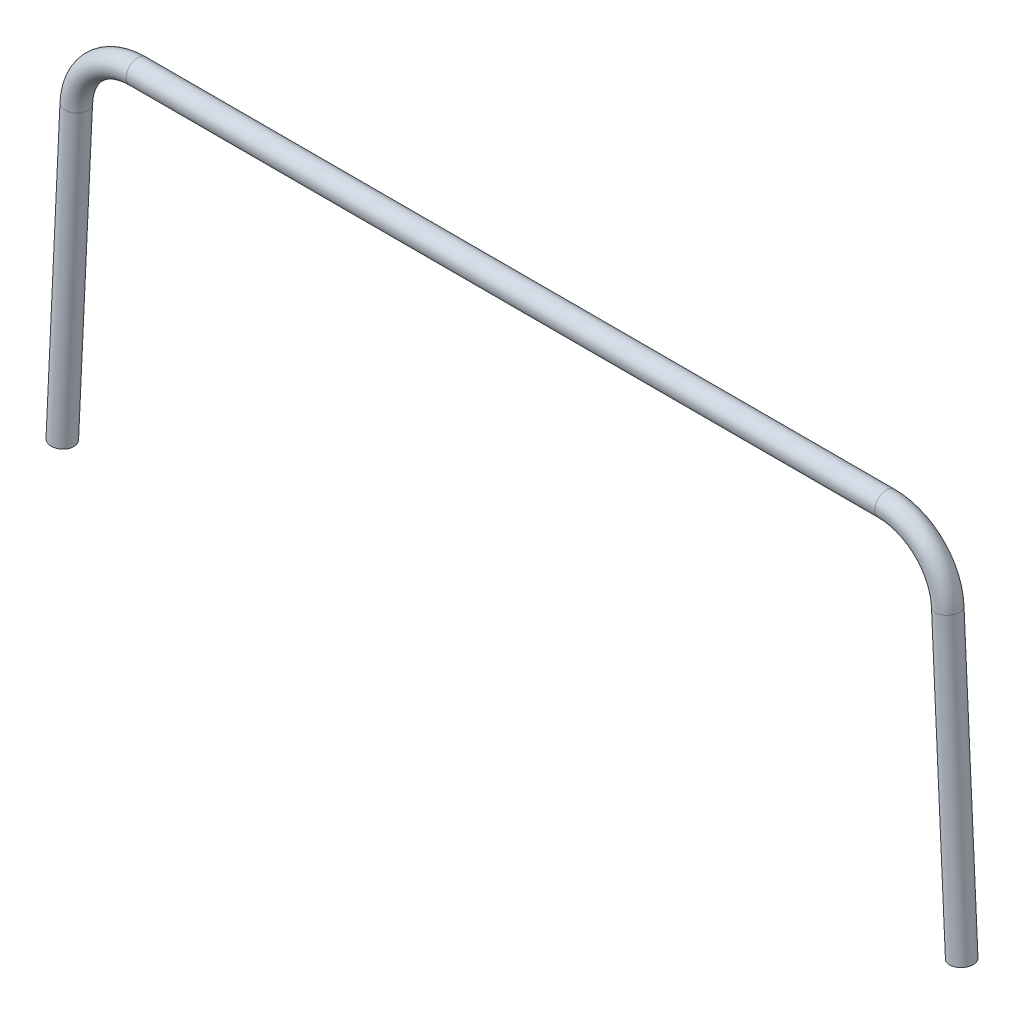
ISO-10303-21;
HEADER;
FILE_DESCRIPTION(('STEP AP214'),'2;1');
FILE_NAME('part.step','',(''),(''),'','','');
FILE_SCHEMA(('AUTOMOTIVE_DESIGN { 1 0 10303 214 1 1 1 1 }'));
ENDSEC;
DATA;
#1=APPLICATION_CONTEXT('core data for automotive mechanical design processes');
#2=APPLICATION_PROTOCOL_DEFINITION('international standard','automotive_design',2000,#1);
#3=PRODUCT_CONTEXT('',#1,'mechanical');
#4=PRODUCT('Part','Part','',(#3));
#5=PRODUCT_RELATED_PRODUCT_CATEGORY('part','',(#4));
#6=PRODUCT_DEFINITION_FORMATION('','',#4);
#7=PRODUCT_DEFINITION_CONTEXT('part definition',#1,'design');
#8=PRODUCT_DEFINITION('design','',#6,#7);
#9=PRODUCT_DEFINITION_SHAPE('','',#8);
#10=(LENGTH_UNIT() NAMED_UNIT(*) SI_UNIT(.MILLI.,.METRE.));
#11=(NAMED_UNIT(*) PLANE_ANGLE_UNIT() SI_UNIT($,.RADIAN.));
#12=(NAMED_UNIT(*) SI_UNIT($,.STERADIAN.) SOLID_ANGLE_UNIT());
#13=UNCERTAINTY_MEASURE_WITH_UNIT(LENGTH_MEASURE(1.E-05),#10,'distance_accuracy_value','');
#14=(GEOMETRIC_REPRESENTATION_CONTEXT(3) GLOBAL_UNCERTAINTY_ASSIGNED_CONTEXT((#13)) GLOBAL_UNIT_ASSIGNED_CONTEXT((#10,
#11,#12)) REPRESENTATION_CONTEXT('',''));
#15=CARTESIAN_POINT('',(0.,0.,0.));
#16=DIRECTION('',(0.,0.,1.));
#17=DIRECTION('',(1.,0.,0.));
#18=AXIS2_PLACEMENT_3D('',#15,#16,#17);
#19=CARTESIAN_POINT('',(719.823686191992,-115.8875,0.));
#20=DIRECTION('',(0.046874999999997,-0.998900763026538,0.));
#21=DIRECTION('',(0.998900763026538,0.046874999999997,0.));
#22=AXIS2_PLACEMENT_3D('',#19,#20,#21);
#23=CYLINDRICAL_SURFACE('',#22,17.8054);
#24=CARTESIAN_POINT('',(742.929059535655,-608.260301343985,0.));
#25=DIRECTION('',(-0.0468749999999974,0.998900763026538,0.));
#26=DIRECTION('',(-0.998900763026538,-0.0468749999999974,0.));
#27=AXIS2_PLACEMENT_3D('',#24,#25,#26);
#28=CIRCLE('',#27,17.8054);
#29=CARTESIAN_POINT('',(725.143231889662,-609.094929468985,0.));
#30=VERTEX_POINT('',#29);
#31=EDGE_CURVE('E54',#30,#30,#28,.T.);
#32=ORIENTED_EDGE('',*,*,#31,.F.);
#33=EDGE_LOOP('',(#32));
#34=FACE_BOUND('',#33,.T.);
#35=CARTESIAN_POINT('',(719.823686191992,-115.887500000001,0.));
#36=DIRECTION('',(-0.0468749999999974,0.998900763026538,0.));
#37=DIRECTION('',(-0.998900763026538,-0.0468749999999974,0.));
#38=AXIS2_PLACEMENT_3D('',#35,#36,#37);
#39=CIRCLE('',#38,17.8054);
#40=CARTESIAN_POINT('',(702.037858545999,-116.722128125,0.));
#41=VERTEX_POINT('',#40);
#42=EDGE_CURVE('E50',#41,#41,#39,.T.);
#43=ORIENTED_EDGE('',*,*,#42,.T.);
#44=EDGE_LOOP('',(#43));
#45=FACE_BOUND('',#44,.T.);
#46=ADVANCED_FACE('F46',(#34,#45),#23,.F.);
#47=CARTESIAN_POINT('',(719.823686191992,-115.8875,0.));
#48=DIRECTION('',(0.046874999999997,-0.998900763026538,0.));
#49=DIRECTION('',(0.998900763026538,0.046874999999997,0.));
#50=AXIS2_PLACEMENT_3D('',#47,#48,#49);
#51=CYLINDRICAL_SURFACE('',#50,19.05);
#52=CARTESIAN_POINT('',(742.929059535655,-608.260301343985,0.));
#53=DIRECTION('',(-0.0468749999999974,0.998900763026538,0.));
#54=DIRECTION('',(-0.998900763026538,-0.0468749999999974,0.));
#55=AXIS2_PLACEMENT_3D('',#52,#53,#54);
#56=CIRCLE('',#55,19.05);
#57=CARTESIAN_POINT('',(723.899999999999,-609.153270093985,0.));
#58=VERTEX_POINT('',#57);
#59=EDGE_CURVE('E58',#58,#58,#56,.T.);
#60=ORIENTED_EDGE('',*,*,#59,.T.);
#61=EDGE_LOOP('',(#60));
#62=FACE_BOUND('',#61,.T.);
#63=CARTESIAN_POINT('',(719.823686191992,-115.887500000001,0.));
#64=DIRECTION('',(-0.0468749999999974,0.998900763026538,0.));
#65=DIRECTION('',(-0.998900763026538,-0.0468749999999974,0.));
#66=AXIS2_PLACEMENT_3D('',#63,#64,#65);
#67=CIRCLE('',#66,19.05);
#68=CARTESIAN_POINT('',(700.794626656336,-116.78046875,0.));
#69=VERTEX_POINT('',#68);
#70=EDGE_CURVE('E12',#69,#69,#67,.T.);
#71=ORIENTED_EDGE('',*,*,#70,.F.);
#72=EDGE_LOOP('',(#71));
#73=FACE_BOUND('',#72,.T.);
#74=ADVANCED_FACE('F73',(#62,#73),#51,.T.);
#75=CARTESIAN_POINT('',(742.929059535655,-608.260301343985,0.));
#76=DIRECTION('',(-0.0468749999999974,0.998900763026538,0.));
#77=DIRECTION('',(-0.998900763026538,-0.0468749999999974,0.));
#78=AXIS2_PLACEMENT_3D('',#75,#76,#77);
#79=PLANE('',#78);
#80=ORIENTED_EDGE('',*,*,#31,.T.);
#81=EDGE_LOOP('',(#80));
#82=FACE_BOUND('',#81,.T.);
#83=ORIENTED_EDGE('',*,*,#59,.F.);
#84=EDGE_LOOP('',(#83));
#85=FACE_BOUND('',#84,.T.);
#86=ADVANCED_FACE('F69',(#82,#85),#79,.F.);
#87=CARTESIAN_POINT('',(719.823686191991,-115.887500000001,0.));
#88=DIRECTION('',(-0.0468749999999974,0.998900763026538,0.));
#89=DIRECTION('',(-0.998900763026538,-0.0468749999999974,0.));
#90=AXIS2_PLACEMENT_3D('',#87,#88,#89);
#91=PLANE('',#90);
#92=ORIENTED_EDGE('',*,*,#42,.F.);
#93=EDGE_LOOP('',(#92));
#94=FACE_BOUND('',#93,.T.);
#95=ORIENTED_EDGE('',*,*,#70,.T.);
#96=EDGE_LOOP('',(#95));
#97=FACE_BOUND('',#96,.T.);
#98=ADVANCED_FACE('F48',(#94,#97),#91,.T.);
#99=CLOSED_SHELL('',(#46,#74,#86,#98));
#100=MANIFOLD_SOLID_BREP('B2',#99);
#101=CARTESIAN_POINT('',(618.335368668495,-120.65,0.));
#102=DIRECTION('',(0.,0.,-1.));
#103=DIRECTION('',(-1.,0.,0.));
#104=AXIS2_PLACEMENT_3D('',#101,#102,#103);
#105=TOROIDAL_SURFACE('',#104,101.600000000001,17.8054);
#106=CARTESIAN_POINT('',(618.335368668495,-19.0499999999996,0.));
#107=DIRECTION('',(-1.,0.,0.));
#108=DIRECTION('',(0.,-1.,0.));
#109=AXIS2_PLACEMENT_3D('',#106,#107,#108);
#110=CIRCLE('',#109,17.8054);
#111=CARTESIAN_POINT('',(618.335368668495,-1.24459999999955,0.));
#112=VERTEX_POINT('',#111);
#113=EDGE_CURVE('E150',#112,#112,#110,.T.);
#114=CARTESIAN_POINT('',(719.823686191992,-115.8875,0.));
#115=DIRECTION('',(0.0468749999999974,-0.998900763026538,0.));
#116=DIRECTION('',(0.998900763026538,0.0468749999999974,0.));
#117=AXIS2_PLACEMENT_3D('',#114,#115,#116);
#118=CIRCLE('',#117,17.8054);
#119=CARTESIAN_POINT('',(737.609513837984,-115.052871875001,0.));
#120=VERTEX_POINT('',#119);
#121=EDGE_CURVE('E140',#120,#120,#118,.T.);
#122=CARTESIAN_POINT('',(618.335368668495,-120.65,0.));
#123=DIRECTION('',(0.,0.,-1.));
#124=DIRECTION('',(-1.,0.,0.));
#125=AXIS2_PLACEMENT_3D('',#122,#123,#124);
#126=CIRCLE('',#125,119.405400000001);
#127=EDGE_CURVE('',#112,#120,#126,.T.);
#128=ORIENTED_EDGE('',*,*,#113,.T.);
#129=ORIENTED_EDGE('',*,*,#121,.T.);
#130=ORIENTED_EDGE('',*,*,#127,.T.);
#131=ORIENTED_EDGE('',*,*,#127,.F.);
#132=EDGE_LOOP('',(#128,#130,#129,#131));
#133=FACE_BOUND('',#132,.T.);
#134=ADVANCED_FACE('F136',(#133),#105,.F.);
#135=CARTESIAN_POINT('',(618.335368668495,-120.65,0.));
#136=DIRECTION('',(0.,0.,-1.));
#137=DIRECTION('',(-1.,0.,0.));
#138=AXIS2_PLACEMENT_3D('',#135,#136,#137);
#139=TOROIDAL_SURFACE('',#138,101.600000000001,19.05);
#140=CARTESIAN_POINT('',(618.335368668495,-19.0499999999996,0.));
#141=DIRECTION('',(-1.,0.,0.));
#142=DIRECTION('',(0.,-1.,0.));
#143=AXIS2_PLACEMENT_3D('',#140,#141,#142);
#144=CIRCLE('',#143,19.05);
#145=CARTESIAN_POINT('',(618.335368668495,4.16333634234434E-13,0.));
#146=VERTEX_POINT('',#145);
#147=EDGE_CURVE('E144',#146,#146,#144,.T.);
#148=CARTESIAN_POINT('',(719.823686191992,-115.8875,0.));
#149=DIRECTION('',(0.0468749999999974,-0.998900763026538,0.));
#150=DIRECTION('',(0.998900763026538,0.0468749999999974,0.));
#151=AXIS2_PLACEMENT_3D('',#148,#149,#150);
#152=CIRCLE('',#151,19.05);
#153=CARTESIAN_POINT('',(738.852745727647,-114.994531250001,0.));
#154=VERTEX_POINT('',#153);
#155=EDGE_CURVE('E45',#154,#154,#152,.T.);
#156=CARTESIAN_POINT('',(618.335368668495,-120.65,0.));
#157=DIRECTION('',(0.,0.,-1.));
#158=DIRECTION('',(-1.,0.,0.));
#159=AXIS2_PLACEMENT_3D('',#156,#157,#158);
#160=CIRCLE('',#159,120.650000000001);
#161=EDGE_CURVE('',#146,#154,#160,.T.);
#162=ORIENTED_EDGE('',*,*,#147,.F.);
#163=ORIENTED_EDGE('',*,*,#155,.F.);
#164=ORIENTED_EDGE('',*,*,#161,.T.);
#165=ORIENTED_EDGE('',*,*,#161,.F.);
#166=EDGE_LOOP('',(#162,#164,#163,#165));
#167=FACE_BOUND('',#166,.T.);
#168=ADVANCED_FACE('F163',(#167),#139,.T.);
#169=CARTESIAN_POINT('',(618.335368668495,-19.05,0.));
#170=DIRECTION('',(-1.,0.,0.));
#171=DIRECTION('',(0.,-1.,0.));
#172=AXIS2_PLACEMENT_3D('',#169,#170,#171);
#173=PLANE('',#172);
#174=ORIENTED_EDGE('',*,*,#113,.F.);
#175=EDGE_LOOP('',(#174));
#176=FACE_BOUND('',#175,.T.);
#177=ORIENTED_EDGE('',*,*,#147,.T.);
#178=EDGE_LOOP('',(#177));
#179=FACE_BOUND('',#178,.T.);
#180=ADVANCED_FACE('F159',(#176,#179),#173,.T.);
#181=CARTESIAN_POINT('',(719.823686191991,-115.887500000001,0.));
#182=DIRECTION('',(0.0468749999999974,-0.998900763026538,0.));
#183=DIRECTION('',(0.998900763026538,0.0468749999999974,0.));
#184=AXIS2_PLACEMENT_3D('',#181,#182,#183);
#185=PLANE('',#184);
#186=ORIENTED_EDGE('',*,*,#121,.F.);
#187=EDGE_LOOP('',(#186));
#188=FACE_BOUND('',#187,.T.);
#189=ORIENTED_EDGE('',*,*,#155,.T.);
#190=EDGE_LOOP('',(#189));
#191=FACE_BOUND('',#190,.T.);
#192=ADVANCED_FACE('F138',(#188,#191),#185,.T.);
#193=CLOSED_SHELL('',(#134,#168,#180,#192));
#194=MANIFOLD_SOLID_BREP('B7',#193);
#195=CARTESIAN_POINT('',(-618.335368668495,-19.0499999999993,0.));
#196=DIRECTION('',(1.,0.,0.));
#197=DIRECTION('',(0.,1.,0.));
#198=AXIS2_PLACEMENT_3D('',#195,#196,#197);
#199=CYLINDRICAL_SURFACE('',#198,17.8054);
#200=CARTESIAN_POINT('',(-618.335368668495,-19.0499999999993,0.));
#201=DIRECTION('',(-1.,0.,0.));
#202=DIRECTION('',(0.,-1.,0.));
#203=AXIS2_PLACEMENT_3D('',#200,#201,#202);
#204=CIRCLE('',#203,17.8054);
#205=CARTESIAN_POINT('',(-618.335368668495,-36.8553999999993,0.));
#206=VERTEX_POINT('',#205);
#207=EDGE_CURVE('E242',#206,#206,#204,.T.);
#208=ORIENTED_EDGE('',*,*,#207,.T.);
#209=EDGE_LOOP('',(#208));
#210=FACE_BOUND('',#209,.T.);
#211=CARTESIAN_POINT('',(618.335368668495,-19.0499999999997,0.));
#212=DIRECTION('',(1.,0.,0.));
#213=DIRECTION('',(0.,1.,0.));
#214=AXIS2_PLACEMENT_3D('',#211,#212,#213);
#215=CIRCLE('',#214,17.8054);
#216=CARTESIAN_POINT('',(618.335368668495,-1.24459999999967,0.));
#217=VERTEX_POINT('',#216);
#218=EDGE_CURVE('E232',#217,#217,#215,.T.);
#219=ORIENTED_EDGE('',*,*,#218,.T.);
#220=EDGE_LOOP('',(#219));
#221=FACE_BOUND('',#220,.T.);
#222=ADVANCED_FACE('F228',(#210,#221),#199,.F.);
#223=CARTESIAN_POINT('',(-618.335368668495,-19.0499999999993,0.));
#224=DIRECTION('',(1.,0.,0.));
#225=DIRECTION('',(0.,1.,0.));
#226=AXIS2_PLACEMENT_3D('',#223,#224,#225);
#227=CYLINDRICAL_SURFACE('',#226,19.05);
#228=CARTESIAN_POINT('',(-618.335368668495,-19.0499999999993,0.));
#229=DIRECTION('',(-1.,0.,0.));
#230=DIRECTION('',(0.,-1.,0.));
#231=AXIS2_PLACEMENT_3D('',#228,#229,#230);
#232=CIRCLE('',#231,19.05);
#233=CARTESIAN_POINT('',(-618.335368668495,-38.0999999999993,0.));
#234=VERTEX_POINT('',#233);
#235=EDGE_CURVE('E236',#234,#234,#232,.T.);
#236=ORIENTED_EDGE('',*,*,#235,.F.);
#237=EDGE_LOOP('',(#236));
#238=FACE_BOUND('',#237,.T.);
#239=CARTESIAN_POINT('',(618.335368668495,-19.0499999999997,0.));
#240=DIRECTION('',(1.,0.,0.));
#241=DIRECTION('',(0.,1.,0.));
#242=AXIS2_PLACEMENT_3D('',#239,#240,#241);
#243=CIRCLE('',#242,19.05);
#244=CARTESIAN_POINT('',(618.335368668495,3.12250225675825E-13,0.));
#245=VERTEX_POINT('',#244);
#246=EDGE_CURVE('E135',#245,#245,#243,.T.);
#247=ORIENTED_EDGE('',*,*,#246,.F.);
#248=EDGE_LOOP('',(#247));
#249=FACE_BOUND('',#248,.T.);
#250=ADVANCED_FACE('F255',(#238,#249),#227,.T.);
#251=CARTESIAN_POINT('',(-618.335368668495,-19.0499999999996,0.));
#252=DIRECTION('',(-1.,0.,0.));
#253=DIRECTION('',(0.,-1.,0.));
#254=AXIS2_PLACEMENT_3D('',#251,#252,#253);
#255=PLANE('',#254);
#256=ORIENTED_EDGE('',*,*,#207,.F.);
#257=EDGE_LOOP('',(#256));
#258=FACE_BOUND('',#257,.T.);
#259=ORIENTED_EDGE('',*,*,#235,.T.);
#260=EDGE_LOOP('',(#259));
#261=FACE_BOUND('',#260,.T.);
#262=ADVANCED_FACE('F251',(#258,#261),#255,.T.);
#263=CARTESIAN_POINT('',(618.335368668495,-19.05,0.));
#264=DIRECTION('',(1.,0.,0.));
#265=DIRECTION('',(0.,1.,0.));
#266=AXIS2_PLACEMENT_3D('',#263,#264,#265);
#267=PLANE('',#266);
#268=ORIENTED_EDGE('',*,*,#218,.F.);
#269=EDGE_LOOP('',(#268));
#270=FACE_BOUND('',#269,.T.);
#271=ORIENTED_EDGE('',*,*,#246,.T.);
#272=EDGE_LOOP('',(#271));
#273=FACE_BOUND('',#272,.T.);
#274=ADVANCED_FACE('F230',(#270,#273),#267,.T.);
#275=CLOSED_SHELL('',(#222,#250,#262,#274));
#276=MANIFOLD_SOLID_BREP('B40',#275);
#277=CARTESIAN_POINT('',(-618.335368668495,-120.65,0.));
#278=DIRECTION('',(0.,0.,-1.));
#279=DIRECTION('',(-1.,0.,0.));
#280=AXIS2_PLACEMENT_3D('',#277,#278,#279);
#281=TOROIDAL_SURFACE('',#280,101.600000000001,17.8054);
#282=CARTESIAN_POINT('',(-719.823686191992,-115.8875,0.));
#283=DIRECTION('',(-0.0468750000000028,-0.998900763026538,0.));
#284=DIRECTION('',(0.998900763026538,-0.0468750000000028,0.));
#285=AXIS2_PLACEMENT_3D('',#282,#283,#284);
#286=CIRCLE('',#285,17.8054);
#287=CARTESIAN_POINT('',(-737.609513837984,-115.052871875,0.));
#288=VERTEX_POINT('',#287);
#289=EDGE_CURVE('E333',#288,#288,#286,.T.);
#290=CARTESIAN_POINT('',(-618.335368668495,-19.0499999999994,0.));
#291=DIRECTION('',(1.,0.,0.));
#292=DIRECTION('',(0.,1.,0.));
#293=AXIS2_PLACEMENT_3D('',#290,#291,#292);
#294=CIRCLE('',#293,17.8054);
#295=CARTESIAN_POINT('',(-618.335368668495,-1.24459999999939,0.));
#296=VERTEX_POINT('',#295);
#297=EDGE_CURVE('E323',#296,#296,#294,.T.);
#298=CARTESIAN_POINT('',(-618.335368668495,-120.65,0.));
#299=DIRECTION('',(0.,0.,-1.));
#300=DIRECTION('',(-1.,0.,0.));
#301=AXIS2_PLACEMENT_3D('',#298,#299,#300);
#302=CIRCLE('',#301,119.405400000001);
#303=EDGE_CURVE('',#288,#296,#302,.T.);
#304=ORIENTED_EDGE('',*,*,#289,.T.);
#305=ORIENTED_EDGE('',*,*,#297,.T.);
#306=ORIENTED_EDGE('',*,*,#303,.T.);
#307=ORIENTED_EDGE('',*,*,#303,.F.);
#308=EDGE_LOOP('',(#304,#306,#305,#307));
#309=FACE_BOUND('',#308,.T.);
#310=ADVANCED_FACE('F319',(#309),#281,.F.);
#311=CARTESIAN_POINT('',(-618.335368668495,-120.65,0.));
#312=DIRECTION('',(0.,0.,-1.));
#313=DIRECTION('',(-1.,0.,0.));
#314=AXIS2_PLACEMENT_3D('',#311,#312,#313);
#315=TOROIDAL_SURFACE('',#314,101.600000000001,19.05);
#316=CARTESIAN_POINT('',(-719.823686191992,-115.8875,0.));
#317=DIRECTION('',(-0.0468750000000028,-0.998900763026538,0.));
#318=DIRECTION('',(0.998900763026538,-0.0468750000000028,0.));
#319=AXIS2_PLACEMENT_3D('',#316,#317,#318);
#320=CIRCLE('',#319,19.05);
#321=CARTESIAN_POINT('',(-738.852745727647,-114.99453125,0.));
#322=VERTEX_POINT('',#321);
#323=EDGE_CURVE('E327',#322,#322,#320,.T.);
#324=CARTESIAN_POINT('',(-618.335368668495,-19.0499999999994,0.));
#325=DIRECTION('',(1.,0.,0.));
#326=DIRECTION('',(0.,1.,0.));
#327=AXIS2_PLACEMENT_3D('',#324,#325,#326);
#328=CIRCLE('',#327,19.05);
#329=CARTESIAN_POINT('',(-618.335368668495,5.96744875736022E-13,0.));
#330=VERTEX_POINT('',#329);
#331=EDGE_CURVE('E227',#330,#330,#328,.T.);
#332=CARTESIAN_POINT('',(-618.335368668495,-120.65,0.));
#333=DIRECTION('',(0.,0.,-1.));
#334=DIRECTION('',(-1.,0.,0.));
#335=AXIS2_PLACEMENT_3D('',#332,#333,#334);
#336=CIRCLE('',#335,120.650000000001);
#337=EDGE_CURVE('',#322,#330,#336,.T.);
#338=ORIENTED_EDGE('',*,*,#323,.F.);
#339=ORIENTED_EDGE('',*,*,#331,.F.);
#340=ORIENTED_EDGE('',*,*,#337,.T.);
#341=ORIENTED_EDGE('',*,*,#337,.F.);
#342=EDGE_LOOP('',(#338,#340,#339,#341));
#343=FACE_BOUND('',#342,.T.);
#344=ADVANCED_FACE('F346',(#343),#315,.T.);
#345=CARTESIAN_POINT('',(-719.823686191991,-115.8875,0.));
#346=DIRECTION('',(-0.0468750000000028,-0.998900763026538,0.));
#347=DIRECTION('',(0.998900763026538,-0.0468750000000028,0.));
#348=AXIS2_PLACEMENT_3D('',#345,#346,#347);
#349=PLANE('',#348);
#350=ORIENTED_EDGE('',*,*,#289,.F.);
#351=EDGE_LOOP('',(#350));
#352=FACE_BOUND('',#351,.T.);
#353=ORIENTED_EDGE('',*,*,#323,.T.);
#354=EDGE_LOOP('',(#353));
#355=FACE_BOUND('',#354,.T.);
#356=ADVANCED_FACE('F342',(#352,#355),#349,.T.);
#357=CARTESIAN_POINT('',(-618.335368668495,-19.0499999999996,0.));
#358=DIRECTION('',(1.,0.,0.));
#359=DIRECTION('',(0.,1.,0.));
#360=AXIS2_PLACEMENT_3D('',#357,#358,#359);
#361=PLANE('',#360);
#362=ORIENTED_EDGE('',*,*,#297,.F.);
#363=EDGE_LOOP('',(#362));
#364=FACE_BOUND('',#363,.T.);
#365=ORIENTED_EDGE('',*,*,#331,.T.);
#366=EDGE_LOOP('',(#365));
#367=FACE_BOUND('',#366,.T.);
#368=ADVANCED_FACE('F321',(#364,#367),#361,.T.);
#369=CLOSED_SHELL('',(#310,#344,#356,#368));
#370=MANIFOLD_SOLID_BREP('B130',#369);
#371=CARTESIAN_POINT('',(-742.929059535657,-608.260301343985,0.));
#372=DIRECTION('',(0.0468750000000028,0.998900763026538,0.));
#373=DIRECTION('',(-0.998900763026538,0.0468750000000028,0.));
#374=AXIS2_PLACEMENT_3D('',#371,#372,#373);
#375=CYLINDRICAL_SURFACE('',#374,17.8054);
#376=CARTESIAN_POINT('',(-742.929059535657,-608.260301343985,0.));
#377=DIRECTION('',(-0.0468750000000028,-0.998900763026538,0.));
#378=DIRECTION('',(0.998900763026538,-0.0468750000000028,0.));
#379=AXIS2_PLACEMENT_3D('',#376,#377,#378);
#380=CIRCLE('',#379,17.8054);
#381=CARTESIAN_POINT('',(-725.143231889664,-609.094929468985,0.));
#382=VERTEX_POINT('',#381);
#383=EDGE_CURVE('E417',#382,#382,#380,.T.);
#384=ORIENTED_EDGE('',*,*,#383,.T.);
#385=EDGE_LOOP('',(#384));
#386=FACE_BOUND('',#385,.T.);
#387=CARTESIAN_POINT('',(-719.823686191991,-115.8875,0.));
#388=DIRECTION('',(0.0468750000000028,0.998900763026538,0.));
#389=DIRECTION('',(-0.998900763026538,0.0468750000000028,0.));
#390=AXIS2_PLACEMENT_3D('',#387,#388,#389);
#391=CIRCLE('',#390,17.8054);
#392=CARTESIAN_POINT('',(-737.609513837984,-115.052871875,0.));
#393=VERTEX_POINT('',#392);
#394=EDGE_CURVE('E407',#393,#393,#391,.T.);
#395=ORIENTED_EDGE('',*,*,#394,.T.);
#396=EDGE_LOOP('',(#395));
#397=FACE_BOUND('',#396,.T.);
#398=ADVANCED_FACE('F403',(#386,#397),#375,.F.);
#399=CARTESIAN_POINT('',(-742.929059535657,-608.260301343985,0.));
#400=DIRECTION('',(0.0468750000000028,0.998900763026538,0.));
#401=DIRECTION('',(-0.998900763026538,0.0468750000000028,0.));
#402=AXIS2_PLACEMENT_3D('',#399,#400,#401);
#403=CYLINDRICAL_SURFACE('',#402,19.05);
#404=CARTESIAN_POINT('',(-742.929059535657,-608.260301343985,0.));
#405=DIRECTION('',(-0.0468750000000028,-0.998900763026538,0.));
#406=DIRECTION('',(0.998900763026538,-0.0468750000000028,0.));
#407=AXIS2_PLACEMENT_3D('',#404,#405,#406);
#408=CIRCLE('',#407,19.05);
#409=CARTESIAN_POINT('',(-723.900000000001,-609.153270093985,0.));
#410=VERTEX_POINT('',#409);
#411=EDGE_CURVE('E411',#410,#410,#408,.T.);
#412=ORIENTED_EDGE('',*,*,#411,.F.);
#413=EDGE_LOOP('',(#412));
#414=FACE_BOUND('',#413,.T.);
#415=CARTESIAN_POINT('',(-719.823686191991,-115.8875,0.));
#416=DIRECTION('',(0.0468750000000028,0.998900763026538,0.));
#417=DIRECTION('',(-0.998900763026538,0.0468750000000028,0.));
#418=AXIS2_PLACEMENT_3D('',#415,#416,#417);
#419=CIRCLE('',#418,19.05);
#420=CARTESIAN_POINT('',(-738.852745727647,-114.99453125,0.));
#421=VERTEX_POINT('',#420);
#422=EDGE_CURVE('E318',#421,#421,#419,.T.);
#423=ORIENTED_EDGE('',*,*,#422,.F.);
#424=EDGE_LOOP('',(#423));
#425=FACE_BOUND('',#424,.T.);
#426=ADVANCED_FACE('F430',(#414,#425),#403,.T.);
#427=CARTESIAN_POINT('',(-742.929059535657,-608.260301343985,0.));
#428=DIRECTION('',(-0.0468750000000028,-0.998900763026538,0.));
#429=DIRECTION('',(0.998900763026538,-0.0468750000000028,0.));
#430=AXIS2_PLACEMENT_3D('',#427,#428,#429);
#431=PLANE('',#430);
#432=ORIENTED_EDGE('',*,*,#383,.F.);
#433=EDGE_LOOP('',(#432));
#434=FACE_BOUND('',#433,.T.);
#435=ORIENTED_EDGE('',*,*,#411,.T.);
#436=EDGE_LOOP('',(#435));
#437=FACE_BOUND('',#436,.T.);
#438=ADVANCED_FACE('F426',(#434,#437),#431,.T.);
#439=CARTESIAN_POINT('',(-719.823686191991,-115.8875,0.));
#440=DIRECTION('',(0.0468750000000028,0.998900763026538,0.));
#441=DIRECTION('',(-0.998900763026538,0.0468750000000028,0.));
#442=AXIS2_PLACEMENT_3D('',#439,#440,#441);
#443=PLANE('',#442);
#444=ORIENTED_EDGE('',*,*,#394,.F.);
#445=EDGE_LOOP('',(#444));
#446=FACE_BOUND('',#445,.T.);
#447=ORIENTED_EDGE('',*,*,#422,.T.);
#448=EDGE_LOOP('',(#447));
#449=FACE_BOUND('',#448,.T.);
#450=ADVANCED_FACE('F405',(#446,#449),#443,.T.);
#451=CLOSED_SHELL('',(#398,#426,#438,#450));
#452=MANIFOLD_SOLID_BREP('B222',#451);
#453=ADVANCED_BREP_SHAPE_REPRESENTATION('',(#18,#100,#194,#276,#370,#452),#14);
#454=SHAPE_DEFINITION_REPRESENTATION(#9,#453);
ENDSEC;
END-ISO-10303-21;
